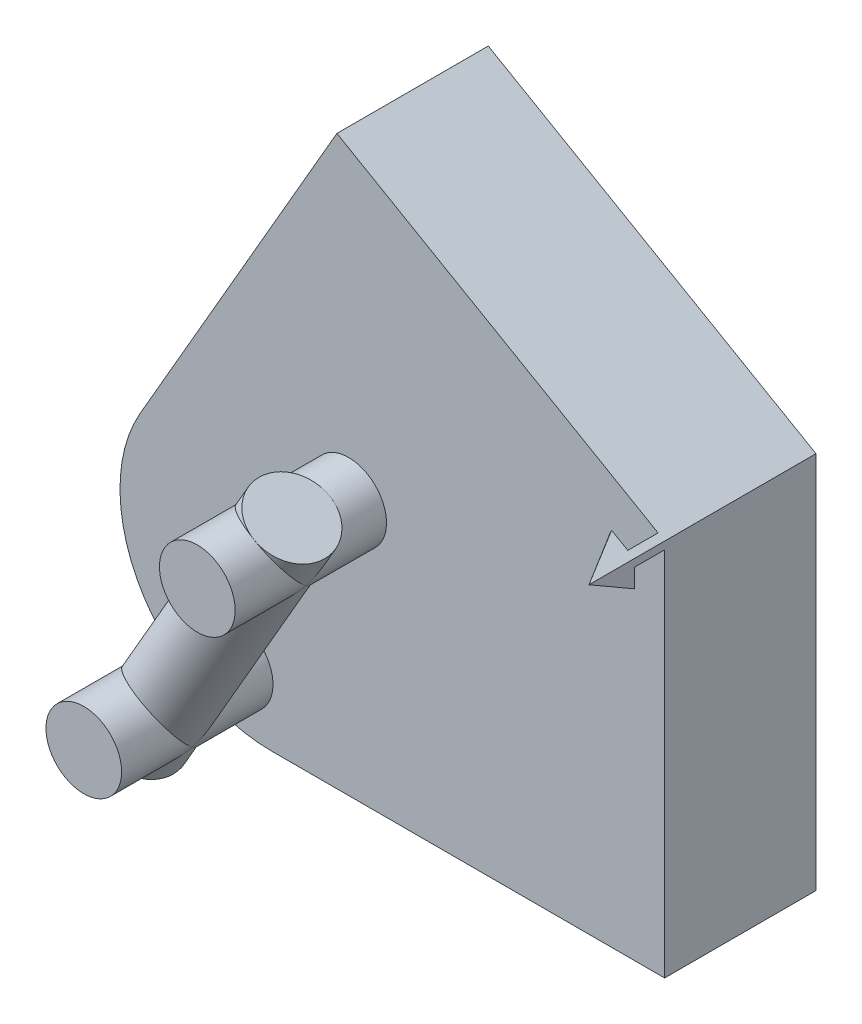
from build123d import *

# Parameters (mm, degrees)
BOSS_EXTRU_1_DEPTH           = 10
CONG_1_R                     = 10
ESQUISSE2_R                  = 2.5
BOSS_EXTRU_2_DEPTH           = 10
BOSS_EXTRU_3_DEPTH           = 10
BOSS_EXTRU_3_DEPTH_BACK      = 10
ESQUISSE3_R                  = 2.5
ENL_V_MAT_EXTRU_1_DEPTH      = 14
ENL_V_MAT_EXTRU_1_DEPTH_BACK = 10


with BuildPart() as part:
    # Esquisse1 → Boss.-Extru.1 (new body)
    with BuildSketch(Plane.XY):
        Polygon((43.301270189, -25), (-43.301270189, -25), (0, 50), align=None)
    extrude(amount=BOSS_EXTRU_1_DEPTH)

    # Cong_1
    cong_1_edges = [part.edges().sort_by_distance(p)[0] for p in [
        (43.301270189, -25, 5),
        (-43.301270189, -25, 5),
        (0, 50, 5),
    ]]
    fillet(cong_1_edges, radius=CONG_1_R)



with BuildPart() as body_2:
    # Esquisse2 → Boss.-Extru.2 (new, symmetric)
    with BuildSketch(Plane(origin=(-12.5, -21.650635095, 0), x_dir=(0.8660254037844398, -0.49999999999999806, 0), z_dir=(-0.499999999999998, -0.8660254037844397, 0))):
        with Locations(Location((-14, 15, 0), (0, 0, 180))):
            Circle(ESQUISSE2_R)
    extrude(amount=BOSS_EXTRU_2_DEPTH, both=True)


with BuildPart() as part_1:
    add(part.part)

    add(body_2.part)  # Boss.-Extru.3 merges body 2
    # Esquisse3 → Boss.-Extru.3 (add, two sides: drawn at the far end of the back side and taken through both)
    with BuildSketch(Plane.XY.offset(10).offset(-BOSS_EXTRU_3_DEPTH_BACK)):
        with Locations(Location((-28.374355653, -21.145825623, 0), (0, 0, 330))):
            Circle(ESQUISSE3_R)
        with Locations(Location((-20.874355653, -8.155444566, 0), (0, 0, 330))):
            Circle(ESQUISSE3_R)
    extrude(amount=BOSS_EXTRU_3_DEPTH + BOSS_EXTRU_3_DEPTH_BACK)

    # Esquisse7 → R_volution1 (revolve)
    with BuildSketch(Plane(origin=(0, 0, 0), x_dir=(0, 0, 1), z_dir=(-0.86602540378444, 0.4999999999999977, 0)), mode=Mode.PRIVATE) as r_volution1_sk:
        Polygon((10, 0), (10, -0.5), (12, -0.5), (12, -1.732050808), (15, 0), align=None)
    revolve(r_volution1_sk.sketch.rotate(Axis((0, 0, 0), (0, 0, 1)), 210), axis=Axis((0, 0, 0), (0, 0, 1)))

    # Esquisse4 → Enl_v. mat.-Extru.1 (cut, two sides: drawn at the far end of the back side and taken through both)
    with BuildSketch(Plane.XY.offset(10).offset(-ENL_V_MAT_EXTRU_1_DEPTH_BACK)):
        with BuildLine():
            Line((-21.650635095, 12.5), (0, 0))
            Line((0, 0), (0, -25))
            Line((0, -25), (25.980762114, -25))
            ThreePointArc((25.980762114, -25), (34.641016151, -20), (34.641016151, -10))
            Line((34.641016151, -10), (8.660254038, 35))
            ThreePointArc((8.660254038, 35), (0, 40), (-8.660254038, 35))
            Line((-8.660254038, 35), (-21.650635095, 12.5))
        make_face()
    extrude(amount=ENL_V_MAT_EXTRU_1_DEPTH + ENL_V_MAT_EXTRU_1_DEPTH_BACK, mode=Mode.SUBTRACT)


solid = part_1.part
